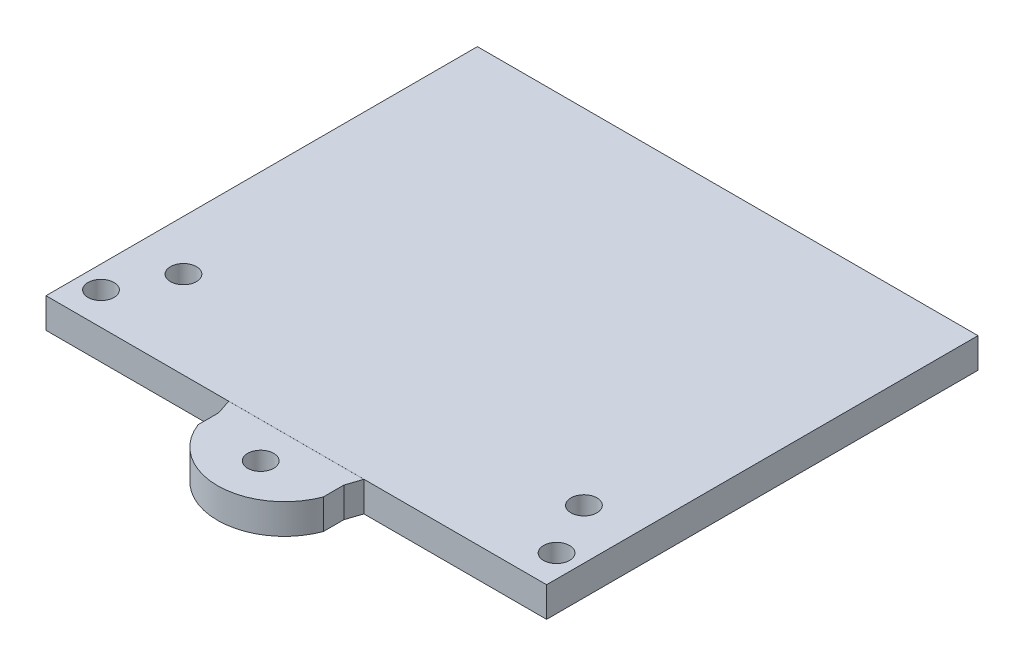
ISO-10303-21;
HEADER;
FILE_DESCRIPTION(('STEP AP214'),'2;1');
FILE_NAME('part.step','',(''),(''),'','','');
FILE_SCHEMA(('AUTOMOTIVE_DESIGN { 1 0 10303 214 1 1 1 1 }'));
ENDSEC;
DATA;
#1=APPLICATION_CONTEXT('core data for automotive mechanical design processes');
#2=APPLICATION_PROTOCOL_DEFINITION('international standard','automotive_design',2000,#1);
#3=PRODUCT_CONTEXT('',#1,'mechanical');
#4=PRODUCT('Part','Part','',(#3));
#5=PRODUCT_RELATED_PRODUCT_CATEGORY('part','',(#4));
#6=PRODUCT_DEFINITION_FORMATION('','',#4);
#7=PRODUCT_DEFINITION_CONTEXT('part definition',#1,'design');
#8=PRODUCT_DEFINITION('design','',#6,#7);
#9=PRODUCT_DEFINITION_SHAPE('','',#8);
#10=(LENGTH_UNIT() NAMED_UNIT(*) SI_UNIT(.MILLI.,.METRE.));
#11=(NAMED_UNIT(*) PLANE_ANGLE_UNIT() SI_UNIT($,.RADIAN.));
#12=(NAMED_UNIT(*) SI_UNIT($,.STERADIAN.) SOLID_ANGLE_UNIT());
#13=UNCERTAINTY_MEASURE_WITH_UNIT(LENGTH_MEASURE(1.E-05),#10,'distance_accuracy_value','');
#14=(GEOMETRIC_REPRESENTATION_CONTEXT(3) GLOBAL_UNCERTAINTY_ASSIGNED_CONTEXT((#13)) GLOBAL_UNIT_ASSIGNED_CONTEXT((#10,
#11,#12)) REPRESENTATION_CONTEXT('',''));
#15=CARTESIAN_POINT('',(0.,0.,0.));
#16=DIRECTION('',(0.,0.,1.));
#17=DIRECTION('',(1.,0.,0.));
#18=AXIS2_PLACEMENT_3D('',#15,#16,#17);
#19=CARTESIAN_POINT('',(-50.,-6.,172.520004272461));
#20=DIRECTION('',(-1.,0.,0.));
#21=DIRECTION('',(0.,0.,1.));
#22=AXIS2_PLACEMENT_3D('',#19,#20,#21);
#23=PLANE('',#22);
#24=DIRECTION('',(0.,0.,1.));
#25=VECTOR('',#24,1.);
#26=CARTESIAN_POINT('',(-50.,0.,172.520004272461));
#27=LINE('',#26,#25);
#28=CARTESIAN_POINT('',(-50.,0.,199.800003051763));
#29=VERTEX_POINT('',#28);
#30=CARTESIAN_POINT('',(-50.,0.,285.980010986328));
#31=VERTEX_POINT('',#30);
#32=EDGE_CURVE('E147',#29,#31,#27,.T.);
#33=ORIENTED_EDGE('',*,*,#32,.F.);
#34=DIRECTION('',(0.,1.,0.));
#35=VECTOR('',#34,1.);
#36=CARTESIAN_POINT('',(-50.,0.,199.800003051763));
#37=LINE('',#36,#35);
#38=CARTESIAN_POINT('',(-50.,-6.,199.800003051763));
#39=VERTEX_POINT('',#38);
#40=EDGE_CURVE('E51',#39,#29,#37,.T.);
#41=ORIENTED_EDGE('',*,*,#40,.F.);
#42=DIRECTION('',(0.,0.,1.));
#43=VECTOR('',#42,1.);
#44=CARTESIAN_POINT('',(-50.,-6.,172.520004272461));
#45=LINE('',#44,#43);
#46=CARTESIAN_POINT('',(-50.,-6.,285.980010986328));
#47=VERTEX_POINT('',#46);
#48=EDGE_CURVE('E133',#39,#47,#45,.T.);
#49=ORIENTED_EDGE('',*,*,#48,.T.);
#50=DIRECTION('',(0.,1.,0.));
#51=VECTOR('',#50,1.);
#52=CARTESIAN_POINT('',(-50.,-6.,285.980010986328));
#53=LINE('',#52,#51);
#54=EDGE_CURVE('E43',#47,#31,#53,.T.);
#55=ORIENTED_EDGE('',*,*,#54,.T.);
#56=EDGE_LOOP('',(#33,#41,#49,#55));
#57=FACE_BOUND('',#56,.T.);
#58=ADVANCED_FACE('F35',(#57),#23,.T.);
#59=CARTESIAN_POINT('',(50.,-6.,172.520004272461));
#60=DIRECTION('',(-1.,0.,0.));
#61=DIRECTION('',(0.,0.,1.));
#62=AXIS2_PLACEMENT_3D('',#59,#60,#61);
#63=PLANE('',#62);
#64=DIRECTION('',(0.,-1.,0.));
#65=VECTOR('',#64,1.);
#66=CARTESIAN_POINT('',(50.,0.,199.800003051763));
#67=LINE('',#66,#65);
#68=CARTESIAN_POINT('',(50.,0.,199.800003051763));
#69=VERTEX_POINT('',#68);
#70=CARTESIAN_POINT('',(50.,-6.,199.800003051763));
#71=VERTEX_POINT('',#70);
#72=EDGE_CURVE('E117',#69,#71,#67,.T.);
#73=ORIENTED_EDGE('',*,*,#72,.F.);
#74=DIRECTION('',(0.,0.,1.));
#75=VECTOR('',#74,1.);
#76=CARTESIAN_POINT('',(50.,0.,172.520004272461));
#77=LINE('',#76,#75);
#78=CARTESIAN_POINT('',(50.,0.,285.980010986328));
#79=VERTEX_POINT('',#78);
#80=EDGE_CURVE('E153',#69,#79,#77,.T.);
#81=ORIENTED_EDGE('',*,*,#80,.T.);
#82=DIRECTION('',(0.,1.,0.));
#83=VECTOR('',#82,1.);
#84=CARTESIAN_POINT('',(50.,-6.,285.980010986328));
#85=LINE('',#84,#83);
#86=CARTESIAN_POINT('',(50.,-6.,285.980010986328));
#87=VERTEX_POINT('',#86);
#88=EDGE_CURVE('E11',#87,#79,#85,.T.);
#89=ORIENTED_EDGE('',*,*,#88,.F.);
#90=DIRECTION('',(0.,0.,1.));
#91=VECTOR('',#90,1.);
#92=CARTESIAN_POINT('',(50.,-6.,172.520004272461));
#93=LINE('',#92,#91);
#94=EDGE_CURVE('E130',#71,#87,#93,.T.);
#95=ORIENTED_EDGE('',*,*,#94,.F.);
#96=EDGE_LOOP('',(#73,#81,#89,#95));
#97=FACE_BOUND('',#96,.T.);
#98=ADVANCED_FACE('F136',(#97),#63,.F.);
#99=CARTESIAN_POINT('',(0.,-6.,0.));
#100=DIRECTION('',(0.,1.,0.));
#101=DIRECTION('',(0.,0.,1.));
#102=AXIS2_PLACEMENT_3D('',#99,#100,#101);
#103=PLANE('',#102);
#104=CARTESIAN_POINT('',(-45.4999956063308,-6.,279.495003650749));
#105=DIRECTION('',(0.,1.,0.));
#106=DIRECTION('',(0.,0.,1.));
#107=AXIS2_PLACEMENT_3D('',#104,#105,#106);
#108=CIRCLE('',#107,2.60000024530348);
#109=CARTESIAN_POINT('',(-45.4999956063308,-6.,282.095003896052));
#110=VERTEX_POINT('',#109);
#111=EDGE_CURVE('E158',#110,#110,#108,.T.);
#112=ORIENTED_EDGE('',*,*,#111,.T.);
#113=EDGE_LOOP('',(#112));
#114=FACE_BOUND('',#113,.T.);
#115=CARTESIAN_POINT('',(45.4999998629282,-6.,279.495002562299));
#116=DIRECTION('',(0.,1.,0.));
#117=DIRECTION('',(0.,0.,1.));
#118=AXIS2_PLACEMENT_3D('',#115,#116,#117);
#119=CIRCLE('',#118,2.59999834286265);
#120=CARTESIAN_POINT('',(45.4999998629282,-6.,282.095000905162));
#121=VERTEX_POINT('',#120);
#122=EDGE_CURVE('E159',#121,#121,#119,.T.);
#123=ORIENTED_EDGE('',*,*,#122,.T.);
#124=EDGE_LOOP('',(#123));
#125=FACE_BOUND('',#124,.T.);
#126=CARTESIAN_POINT('',(-40.0000031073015,-6.,268.520004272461));
#127=DIRECTION('',(0.,1.,0.));
#128=DIRECTION('',(0.,0.,1.));
#129=AXIS2_PLACEMENT_3D('',#126,#127,#128);
#130=CIRCLE('',#129,2.60000505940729);
#131=CARTESIAN_POINT('',(-40.0000031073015,-6.,271.120009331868));
#132=VERTEX_POINT('',#131);
#133=EDGE_CURVE('E162',#132,#132,#130,.T.);
#134=ORIENTED_EDGE('',*,*,#133,.T.);
#135=EDGE_LOOP('',(#134));
#136=FACE_BOUND('',#135,.T.);
#137=CARTESIAN_POINT('',(39.9999982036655,-6.,268.519992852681));
#138=DIRECTION('',(0.,1.,0.));
#139=DIRECTION('',(0.,0.,1.));
#140=AXIS2_PLACEMENT_3D('',#137,#138,#139);
#141=CIRCLE('',#140,2.6000065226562);
#142=CARTESIAN_POINT('',(39.9999982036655,-6.,271.119999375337));
#143=VERTEX_POINT('',#142);
#144=EDGE_CURVE('E165',#143,#143,#141,.T.);
#145=ORIENTED_EDGE('',*,*,#144,.T.);
#146=EDGE_LOOP('',(#145));
#147=FACE_BOUND('',#146,.T.);
#148=DIRECTION('',(-1.,0.,0.));
#149=VECTOR('',#148,1.);
#150=CARTESIAN_POINT('',(50.,-6.,199.800003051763));
#151=LINE('',#150,#149);
#152=EDGE_CURVE('E120',#71,#39,#151,.T.);
#153=ORIENTED_EDGE('',*,*,#152,.F.);
#154=ORIENTED_EDGE('',*,*,#94,.T.);
#155=DIRECTION('',(1.,0.,0.));
#156=VECTOR('',#155,1.);
#157=CARTESIAN_POINT('',(-50.,-6.,285.980010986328));
#158=LINE('',#157,#156);
#159=CARTESIAN_POINT('',(13.5,-6.,285.980010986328));
#160=VERTEX_POINT('',#159);
#161=EDGE_CURVE('E144',#160,#87,#158,.T.);
#162=ORIENTED_EDGE('',*,*,#161,.F.);
#163=CARTESIAN_POINT('',(-13.5,-6.,285.980010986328));
#164=VERTEX_POINT('',#163);
#165=EDGE_CURVE('E142',#164,#160,#158,.T.);
#166=ORIENTED_EDGE('',*,*,#165,.F.);
#167=EDGE_CURVE('E137',#47,#164,#158,.T.);
#168=ORIENTED_EDGE('',*,*,#167,.F.);
#169=ORIENTED_EDGE('',*,*,#48,.F.);
#170=EDGE_LOOP('',(#153,#154,#162,#166,#168,#169));
#171=FACE_BOUND('',#170,.T.);
#172=ADVANCED_FACE('F128',(#114,#125,#136,#147,#171),#103,.F.);
#173=CARTESIAN_POINT('',(0.,0.,0.));
#174=DIRECTION('',(0.,1.,0.));
#175=DIRECTION('',(0.,0.,1.));
#176=AXIS2_PLACEMENT_3D('',#173,#174,#175);
#177=PLANE('',#176);
#178=CARTESIAN_POINT('',(-45.4999956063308,0.,279.495003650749));
#179=DIRECTION('',(0.,1.,0.));
#180=DIRECTION('',(0.,0.,1.));
#181=AXIS2_PLACEMENT_3D('',#178,#179,#180);
#182=CIRCLE('',#181,2.60000024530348);
#183=CARTESIAN_POINT('',(-45.4999956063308,0.,282.095003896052));
#184=VERTEX_POINT('',#183);
#185=EDGE_CURVE('E155',#184,#184,#182,.T.);
#186=ORIENTED_EDGE('',*,*,#185,.F.);
#187=EDGE_LOOP('',(#186));
#188=FACE_BOUND('',#187,.T.);
#189=CARTESIAN_POINT('',(45.4999998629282,0.,279.495002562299));
#190=DIRECTION('',(0.,1.,0.));
#191=DIRECTION('',(0.,0.,1.));
#192=AXIS2_PLACEMENT_3D('',#189,#190,#191);
#193=CIRCLE('',#192,2.59999834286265);
#194=CARTESIAN_POINT('',(45.4999998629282,0.,282.095000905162));
#195=VERTEX_POINT('',#194);
#196=EDGE_CURVE('E160',#195,#195,#193,.T.);
#197=ORIENTED_EDGE('',*,*,#196,.F.);
#198=EDGE_LOOP('',(#197));
#199=FACE_BOUND('',#198,.T.);
#200=CARTESIAN_POINT('',(-40.0000031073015,0.,268.520004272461));
#201=DIRECTION('',(0.,1.,0.));
#202=DIRECTION('',(0.,0.,1.));
#203=AXIS2_PLACEMENT_3D('',#200,#201,#202);
#204=CIRCLE('',#203,2.60000505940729);
#205=CARTESIAN_POINT('',(-40.0000031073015,0.,271.120009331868));
#206=VERTEX_POINT('',#205);
#207=EDGE_CURVE('E163',#206,#206,#204,.T.);
#208=ORIENTED_EDGE('',*,*,#207,.F.);
#209=EDGE_LOOP('',(#208));
#210=FACE_BOUND('',#209,.T.);
#211=CARTESIAN_POINT('',(39.9999982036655,0.,268.519992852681));
#212=DIRECTION('',(0.,1.,0.));
#213=DIRECTION('',(0.,0.,1.));
#214=AXIS2_PLACEMENT_3D('',#211,#212,#213);
#215=CIRCLE('',#214,2.6000065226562);
#216=CARTESIAN_POINT('',(39.9999982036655,0.,271.119999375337));
#217=VERTEX_POINT('',#216);
#218=EDGE_CURVE('E38',#217,#217,#215,.T.);
#219=ORIENTED_EDGE('',*,*,#218,.F.);
#220=EDGE_LOOP('',(#219));
#221=FACE_BOUND('',#220,.T.);
#222=ORIENTED_EDGE('',*,*,#80,.F.);
#223=DIRECTION('',(1.,0.,0.));
#224=VECTOR('',#223,1.);
#225=CARTESIAN_POINT('',(50.,0.,199.800003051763));
#226=LINE('',#225,#224);
#227=EDGE_CURVE('E121',#29,#69,#226,.T.);
#228=ORIENTED_EDGE('',*,*,#227,.F.);
#229=ORIENTED_EDGE('',*,*,#32,.T.);
#230=DIRECTION('',(1.,0.,0.));
#231=VECTOR('',#230,1.);
#232=CARTESIAN_POINT('',(-50.,0.,285.980010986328));
#233=LINE('',#232,#231);
#234=EDGE_CURVE('E149',#31,#79,#233,.T.);
#235=ORIENTED_EDGE('',*,*,#234,.T.);
#236=EDGE_LOOP('',(#222,#228,#229,#235));
#237=FACE_BOUND('',#236,.T.);
#238=ADVANCED_FACE('F266',(#188,#199,#210,#221,#237),#177,.T.);
#239=CARTESIAN_POINT('',(-50.,-6.,285.980010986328));
#240=DIRECTION('',(0.,0.,1.));
#241=DIRECTION('',(1.,0.,0.));
#242=AXIS2_PLACEMENT_3D('',#239,#240,#241);
#243=PLANE('',#242);
#244=DIRECTION('',(0.,-1.,0.));
#245=VECTOR('',#244,1.);
#246=CARTESIAN_POINT('',(-13.5,-0.00999999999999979,285.980010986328));
#247=LINE('',#246,#245);
#248=CARTESIAN_POINT('',(-13.5,-0.00999999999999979,285.980010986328));
#249=VERTEX_POINT('',#248);
#250=EDGE_CURVE('E233',#249,#164,#247,.T.);
#251=ORIENTED_EDGE('',*,*,#250,.F.);
#252=DIRECTION('',(1.,0.,0.));
#253=VECTOR('',#252,1.);
#254=CARTESIAN_POINT('',(-13.5,-0.00999999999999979,285.980010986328));
#255=LINE('',#254,#253);
#256=CARTESIAN_POINT('',(13.5,-0.00999999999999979,285.980010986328));
#257=VERTEX_POINT('',#256);
#258=EDGE_CURVE('E196',#249,#257,#255,.T.);
#259=ORIENTED_EDGE('',*,*,#258,.T.);
#260=DIRECTION('',(0.,-1.,0.));
#261=VECTOR('',#260,1.);
#262=CARTESIAN_POINT('',(13.5,-0.00999999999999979,285.980010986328));
#263=LINE('',#262,#261);
#264=EDGE_CURVE('E230',#257,#160,#263,.T.);
#265=ORIENTED_EDGE('',*,*,#264,.T.);
#266=ORIENTED_EDGE('',*,*,#161,.T.);
#267=ORIENTED_EDGE('',*,*,#88,.T.);
#268=ORIENTED_EDGE('',*,*,#234,.F.);
#269=ORIENTED_EDGE('',*,*,#54,.F.);
#270=ORIENTED_EDGE('',*,*,#167,.T.);
#271=EDGE_LOOP('',(#251,#259,#265,#266,#267,#268,#269,#270));
#272=FACE_BOUND('',#271,.T.);
#273=ADVANCED_FACE('F245',(#272),#243,.T.);
#274=CARTESIAN_POINT('',(-12.5,-0.00999999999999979,288.980010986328));
#275=DIRECTION('',(-1.,0.,0.));
#276=DIRECTION('',(0.,0.,1.));
#277=AXIS2_PLACEMENT_3D('',#274,#275,#276);
#278=PLANE('',#277);
#279=DIRECTION('',(0.,0.,-1.));
#280=VECTOR('',#279,1.);
#281=CARTESIAN_POINT('',(-12.5,-6.01,288.980010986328));
#282=LINE('',#281,#280);
#283=CARTESIAN_POINT('',(-12.5,-6.01,293.095001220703));
#284=VERTEX_POINT('',#283);
#285=CARTESIAN_POINT('',(-12.5,-6.01,288.980010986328));
#286=VERTEX_POINT('',#285);
#287=EDGE_CURVE('E186',#284,#286,#282,.T.);
#288=ORIENTED_EDGE('',*,*,#287,.F.);
#289=DIRECTION('',(0.,-1.,0.));
#290=VECTOR('',#289,1.);
#291=CARTESIAN_POINT('',(-12.5,-0.00999999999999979,293.095001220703));
#292=LINE('',#291,#290);
#293=CARTESIAN_POINT('',(-12.5,-0.00999999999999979,293.095001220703));
#294=VERTEX_POINT('',#293);
#295=EDGE_CURVE('E150',#294,#284,#292,.T.);
#296=ORIENTED_EDGE('',*,*,#295,.F.);
#297=DIRECTION('',(0.,0.,-1.));
#298=VECTOR('',#297,1.);
#299=CARTESIAN_POINT('',(-12.5,-0.00999999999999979,288.980010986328));
#300=LINE('',#299,#298);
#301=CARTESIAN_POINT('',(-12.5,-0.00999999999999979,288.980010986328));
#302=VERTEX_POINT('',#301);
#303=EDGE_CURVE('E189',#294,#302,#300,.T.);
#304=ORIENTED_EDGE('',*,*,#303,.T.);
#305=DIRECTION('',(0.,-1.,0.));
#306=VECTOR('',#305,1.);
#307=CARTESIAN_POINT('',(-12.5,-0.00999999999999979,288.980010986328));
#308=LINE('',#307,#306);
#309=EDGE_CURVE('E208',#302,#286,#308,.T.);
#310=ORIENTED_EDGE('',*,*,#309,.T.);
#311=EDGE_LOOP('',(#288,#296,#304,#310));
#312=FACE_BOUND('',#311,.T.);
#313=ADVANCED_FACE('F274',(#312),#278,.T.);
#314=CARTESIAN_POINT('',(0.,-0.00999999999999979,288.333976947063));
#315=DIRECTION('',(0.,-1.,0.));
#316=DIRECTION('',(0.,0.,-1.));
#317=AXIS2_PLACEMENT_3D('',#314,#315,#316);
#318=CYLINDRICAL_SURFACE('',#317,13.3759991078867);
#319=CARTESIAN_POINT('',(0.,-6.01,288.333976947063));
#320=DIRECTION('',(0.,-1.,0.));
#321=DIRECTION('',(0.,0.,1.));
#322=AXIS2_PLACEMENT_3D('',#319,#320,#321);
#323=CIRCLE('',#322,13.3759991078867);
#324=CARTESIAN_POINT('',(12.5,-6.01,293.095001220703));
#325=VERTEX_POINT('',#324);
#326=EDGE_CURVE('E193',#325,#284,#323,.T.);
#327=ORIENTED_EDGE('',*,*,#326,.F.);
#328=DIRECTION('',(0.,-1.,0.));
#329=VECTOR('',#328,1.);
#330=CARTESIAN_POINT('',(12.5,-0.00999999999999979,293.095001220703));
#331=LINE('',#330,#329);
#332=CARTESIAN_POINT('',(12.5,-0.00999999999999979,293.095001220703));
#333=VERTEX_POINT('',#332);
#334=EDGE_CURVE('E226',#333,#325,#331,.T.);
#335=ORIENTED_EDGE('',*,*,#334,.F.);
#336=CARTESIAN_POINT('',(0.,-0.00999999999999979,288.333976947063));
#337=DIRECTION('',(0.,-1.,0.));
#338=DIRECTION('',(0.,0.,1.));
#339=AXIS2_PLACEMENT_3D('',#336,#337,#338);
#340=CIRCLE('',#339,13.3759991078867);
#341=EDGE_CURVE('E205',#333,#294,#340,.T.);
#342=ORIENTED_EDGE('',*,*,#341,.T.);
#343=ORIENTED_EDGE('',*,*,#295,.T.);
#344=EDGE_LOOP('',(#327,#335,#342,#343));
#345=FACE_BOUND('',#344,.T.);
#346=ADVANCED_FACE('F382',(#345),#318,.T.);
#347=CARTESIAN_POINT('',(12.5,-0.00999999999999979,288.980010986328));
#348=DIRECTION('',(1.,0.,0.));
#349=DIRECTION('',(0.,0.,-1.));
#350=AXIS2_PLACEMENT_3D('',#347,#348,#349);
#351=PLANE('',#350);
#352=DIRECTION('',(0.,0.,1.));
#353=VECTOR('',#352,1.);
#354=CARTESIAN_POINT('',(12.5,-6.01,288.980010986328));
#355=LINE('',#354,#353);
#356=CARTESIAN_POINT('',(12.5,-6.01,288.980010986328));
#357=VERTEX_POINT('',#356);
#358=EDGE_CURVE('E220',#357,#325,#355,.T.);
#359=ORIENTED_EDGE('',*,*,#358,.F.);
#360=DIRECTION('',(0.,-1.,0.));
#361=VECTOR('',#360,1.);
#362=CARTESIAN_POINT('',(12.5,-0.00999999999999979,288.980010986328));
#363=LINE('',#362,#361);
#364=CARTESIAN_POINT('',(12.5,-0.00999999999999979,288.980010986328));
#365=VERTEX_POINT('',#364);
#366=EDGE_CURVE('E228',#365,#357,#363,.T.);
#367=ORIENTED_EDGE('',*,*,#366,.F.);
#368=DIRECTION('',(0.,0.,1.));
#369=VECTOR('',#368,1.);
#370=CARTESIAN_POINT('',(12.5,-0.00999999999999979,288.980010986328));
#371=LINE('',#370,#369);
#372=EDGE_CURVE('E202',#365,#333,#371,.T.);
#373=ORIENTED_EDGE('',*,*,#372,.T.);
#374=ORIENTED_EDGE('',*,*,#334,.T.);
#375=EDGE_LOOP('',(#359,#367,#373,#374));
#376=FACE_BOUND('',#375,.T.);
#377=ADVANCED_FACE('F256',(#376),#351,.T.);
#378=CARTESIAN_POINT('',(13.5,-0.00999999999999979,285.980010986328));
#379=DIRECTION('',(0.948683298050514,0.,0.316227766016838));
#380=DIRECTION('',(0.316227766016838,0.,-0.948683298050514));
#381=AXIS2_PLACEMENT_3D('',#378,#379,#380);
#382=PLANE('',#381);
#383=DIRECTION('',(-0.316227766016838,0.,0.948683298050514));
#384=VECTOR('',#383,1.);
#385=CARTESIAN_POINT('',(13.5,-6.01,285.980010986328));
#386=LINE('',#385,#384);
#387=CARTESIAN_POINT('',(13.5,-6.01,285.980010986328));
#388=VERTEX_POINT('',#387);
#389=EDGE_CURVE('E217',#388,#357,#386,.T.);
#390=ORIENTED_EDGE('',*,*,#389,.F.);
#391=EDGE_CURVE('E59',#160,#388,#263,.T.);
#392=ORIENTED_EDGE('',*,*,#391,.F.);
#393=ORIENTED_EDGE('',*,*,#264,.F.);
#394=DIRECTION('',(-0.316227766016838,0.,0.948683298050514));
#395=VECTOR('',#394,1.);
#396=CARTESIAN_POINT('',(13.5,-0.00999999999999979,285.980010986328));
#397=LINE('',#396,#395);
#398=EDGE_CURVE('E199',#257,#365,#397,.T.);
#399=ORIENTED_EDGE('',*,*,#398,.T.);
#400=ORIENTED_EDGE('',*,*,#366,.T.);
#401=EDGE_LOOP('',(#390,#392,#393,#399,#400));
#402=FACE_BOUND('',#401,.T.);
#403=ADVANCED_FACE('F247',(#402),#382,.T.);
#404=CARTESIAN_POINT('',(-13.5,-0.00999999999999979,285.980010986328));
#405=DIRECTION('',(0.,0.,-1.));
#406=DIRECTION('',(-1.,0.,0.));
#407=AXIS2_PLACEMENT_3D('',#404,#405,#406);
#408=PLANE('',#407);
#409=CARTESIAN_POINT('',(-13.5,-6.01,285.980010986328));
#410=VERTEX_POINT('',#409);
#411=EDGE_CURVE('E236',#164,#410,#247,.T.);
#412=ORIENTED_EDGE('',*,*,#411,.F.);
#413=ORIENTED_EDGE('',*,*,#165,.T.);
#414=ORIENTED_EDGE('',*,*,#391,.T.);
#415=DIRECTION('',(1.,0.,0.));
#416=VECTOR('',#415,1.);
#417=CARTESIAN_POINT('',(-13.5,-6.01,285.980010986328));
#418=LINE('',#417,#416);
#419=EDGE_CURVE('E214',#410,#388,#418,.T.);
#420=ORIENTED_EDGE('',*,*,#419,.F.);
#421=EDGE_LOOP('',(#412,#413,#414,#420));
#422=FACE_BOUND('',#421,.T.);
#423=ADVANCED_FACE('F242',(#422),#408,.T.);
#424=CARTESIAN_POINT('',(-12.5,-0.00999999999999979,288.980010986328));
#425=DIRECTION('',(-0.948683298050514,0.,0.316227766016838));
#426=DIRECTION('',(0.316227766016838,0.,0.948683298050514));
#427=AXIS2_PLACEMENT_3D('',#424,#425,#426);
#428=PLANE('',#427);
#429=DIRECTION('',(-0.316227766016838,0.,-0.948683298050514));
#430=VECTOR('',#429,1.);
#431=CARTESIAN_POINT('',(-12.5,-6.01,288.980010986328));
#432=LINE('',#431,#430);
#433=EDGE_CURVE('E211',#286,#410,#432,.T.);
#434=ORIENTED_EDGE('',*,*,#433,.F.);
#435=ORIENTED_EDGE('',*,*,#309,.F.);
#436=DIRECTION('',(-0.316227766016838,0.,-0.948683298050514));
#437=VECTOR('',#436,1.);
#438=CARTESIAN_POINT('',(-12.5,-0.00999999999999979,288.980010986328));
#439=LINE('',#438,#437);
#440=EDGE_CURVE('E192',#302,#249,#439,.T.);
#441=ORIENTED_EDGE('',*,*,#440,.T.);
#442=ORIENTED_EDGE('',*,*,#250,.T.);
#443=ORIENTED_EDGE('',*,*,#411,.T.);
#444=EDGE_LOOP('',(#434,#435,#441,#442,#443));
#445=FACE_BOUND('',#444,.T.);
#446=ADVANCED_FACE('F262',(#445),#428,.T.);
#447=CARTESIAN_POINT('',(0.,-0.00999999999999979,288.333976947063));
#448=DIRECTION('',(0.,1.,0.));
#449=DIRECTION('',(0.,0.,1.));
#450=AXIS2_PLACEMENT_3D('',#447,#448,#449);
#451=PLANE('',#450);
#452=CARTESIAN_POINT('',(-2.23523894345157E-06,-0.00999999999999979,293.094995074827));
#453=DIRECTION('',(0.,-1.,0.));
#454=DIRECTION('',(0.,0.,-1.));
#455=AXIS2_PLACEMENT_3D('',#452,#453,#454);
#456=CIRCLE('',#455,2.6000018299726);
#457=CARTESIAN_POINT('',(-2.23523894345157E-06,-0.00999999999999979,290.494993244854));
#458=VERTEX_POINT('',#457);
#459=EDGE_CURVE('E183',#458,#458,#456,.T.);
#460=ORIENTED_EDGE('',*,*,#459,.T.);
#461=EDGE_LOOP('',(#460));
#462=FACE_BOUND('',#461,.T.);
#463=ORIENTED_EDGE('',*,*,#303,.F.);
#464=ORIENTED_EDGE('',*,*,#341,.F.);
#465=ORIENTED_EDGE('',*,*,#372,.F.);
#466=ORIENTED_EDGE('',*,*,#398,.F.);
#467=ORIENTED_EDGE('',*,*,#258,.F.);
#468=ORIENTED_EDGE('',*,*,#440,.F.);
#469=EDGE_LOOP('',(#463,#464,#465,#466,#467,#468));
#470=FACE_BOUND('',#469,.T.);
#471=ADVANCED_FACE('F251',(#462,#470),#451,.T.);
#472=CARTESIAN_POINT('',(0.,-6.01,288.333976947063));
#473=DIRECTION('',(0.,1.,0.));
#474=DIRECTION('',(0.,0.,1.));
#475=AXIS2_PLACEMENT_3D('',#472,#473,#474);
#476=PLANE('',#475);
#477=CARTESIAN_POINT('',(-2.23523894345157E-06,-6.01,293.094995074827));
#478=DIRECTION('',(0.,-1.,0.));
#479=DIRECTION('',(0.,0.,-1.));
#480=AXIS2_PLACEMENT_3D('',#477,#478,#479);
#481=CIRCLE('',#480,2.6000018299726);
#482=CARTESIAN_POINT('',(-2.23523894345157E-06,-6.01,290.494993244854));
#483=VERTEX_POINT('',#482);
#484=EDGE_CURVE('E182',#483,#483,#481,.T.);
#485=ORIENTED_EDGE('',*,*,#484,.F.);
#486=EDGE_LOOP('',(#485));
#487=FACE_BOUND('',#486,.T.);
#488=ORIENTED_EDGE('',*,*,#287,.T.);
#489=ORIENTED_EDGE('',*,*,#433,.T.);
#490=ORIENTED_EDGE('',*,*,#419,.T.);
#491=ORIENTED_EDGE('',*,*,#389,.T.);
#492=ORIENTED_EDGE('',*,*,#358,.T.);
#493=ORIENTED_EDGE('',*,*,#326,.T.);
#494=EDGE_LOOP('',(#488,#489,#490,#491,#492,#493));
#495=FACE_BOUND('',#494,.T.);
#496=ADVANCED_FACE('F258',(#487,#495),#476,.F.);
#497=CARTESIAN_POINT('',(-2.23523894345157E-06,-0.00999999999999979,293.094995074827));
#498=DIRECTION('',(0.,-1.,0.));
#499=DIRECTION('',(0.,0.,-1.));
#500=AXIS2_PLACEMENT_3D('',#497,#498,#499);
#501=CYLINDRICAL_SURFACE('',#500,2.6000018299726);
#502=ORIENTED_EDGE('',*,*,#459,.F.);
#503=EDGE_LOOP('',(#502));
#504=FACE_BOUND('',#503,.T.);
#505=ORIENTED_EDGE('',*,*,#484,.T.);
#506=EDGE_LOOP('',(#505));
#507=FACE_BOUND('',#506,.T.);
#508=ADVANCED_FACE('F335',(#504,#507),#501,.F.);
#509=CARTESIAN_POINT('',(-45.4999956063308,0.49,279.495003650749));
#510=DIRECTION('',(0.,-1.,0.));
#511=DIRECTION('',(0.,0.,-1.));
#512=AXIS2_PLACEMENT_3D('',#509,#510,#511);
#513=CYLINDRICAL_SURFACE('',#512,2.60000024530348);
#514=ORIENTED_EDGE('',*,*,#185,.T.);
#515=EDGE_LOOP('',(#514));
#516=FACE_BOUND('',#515,.T.);
#517=ORIENTED_EDGE('',*,*,#111,.F.);
#518=EDGE_LOOP('',(#517));
#519=FACE_BOUND('',#518,.T.);
#520=ADVANCED_FACE('F327',(#516,#519),#513,.F.);
#521=CARTESIAN_POINT('',(45.4999998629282,0.49,279.495002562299));
#522=DIRECTION('',(0.,-1.,0.));
#523=DIRECTION('',(0.,0.,-1.));
#524=AXIS2_PLACEMENT_3D('',#521,#522,#523);
#525=CYLINDRICAL_SURFACE('',#524,2.59999834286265);
#526=ORIENTED_EDGE('',*,*,#196,.T.);
#527=EDGE_LOOP('',(#526));
#528=FACE_BOUND('',#527,.T.);
#529=ORIENTED_EDGE('',*,*,#122,.F.);
#530=EDGE_LOOP('',(#529));
#531=FACE_BOUND('',#530,.T.);
#532=ADVANCED_FACE('F320',(#528,#531),#525,.F.);
#533=CARTESIAN_POINT('',(-40.0000031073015,0.49,268.520004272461));
#534=DIRECTION('',(0.,-1.,0.));
#535=DIRECTION('',(0.,0.,-1.));
#536=AXIS2_PLACEMENT_3D('',#533,#534,#535);
#537=CYLINDRICAL_SURFACE('',#536,2.60000505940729);
#538=ORIENTED_EDGE('',*,*,#207,.T.);
#539=EDGE_LOOP('',(#538));
#540=FACE_BOUND('',#539,.T.);
#541=ORIENTED_EDGE('',*,*,#133,.F.);
#542=EDGE_LOOP('',(#541));
#543=FACE_BOUND('',#542,.T.);
#544=ADVANCED_FACE('F313',(#540,#543),#537,.F.);
#545=CARTESIAN_POINT('',(39.9999982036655,0.49,268.519992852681));
#546=DIRECTION('',(0.,-1.,0.));
#547=DIRECTION('',(0.,0.,-1.));
#548=AXIS2_PLACEMENT_3D('',#545,#546,#547);
#549=CYLINDRICAL_SURFACE('',#548,2.6000065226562);
#550=ORIENTED_EDGE('',*,*,#218,.T.);
#551=EDGE_LOOP('',(#550));
#552=FACE_BOUND('',#551,.T.);
#553=ORIENTED_EDGE('',*,*,#144,.F.);
#554=EDGE_LOOP('',(#553));
#555=FACE_BOUND('',#554,.T.);
#556=ADVANCED_FACE('F303',(#552,#555),#549,.F.);
#557=CARTESIAN_POINT('',(0.,0.,199.800003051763));
#558=DIRECTION('',(0.,0.,-1.));
#559=DIRECTION('',(-1.,0.,0.));
#560=AXIS2_PLACEMENT_3D('',#557,#558,#559);
#561=PLANE('',#560);
#562=ORIENTED_EDGE('',*,*,#72,.T.);
#563=ORIENTED_EDGE('',*,*,#152,.T.);
#564=ORIENTED_EDGE('',*,*,#40,.T.);
#565=ORIENTED_EDGE('',*,*,#227,.T.);
#566=EDGE_LOOP('',(#562,#563,#564,#565));
#567=FACE_BOUND('',#566,.T.);
#568=ADVANCED_FACE('F119',(#567),#561,.T.);
#569=CLOSED_SHELL('',(#58,#98,#172,#238,#273,#313,#346,#377,#403,#423,#446,#471,#496,#508,#520,
#532,#544,#556,#568));
#570=MANIFOLD_SOLID_BREP('B2',#569);
#571=ADVANCED_BREP_SHAPE_REPRESENTATION('',(#18,#570),#14);
#572=SHAPE_DEFINITION_REPRESENTATION(#9,#571);
ENDSEC;
END-ISO-10303-21;
